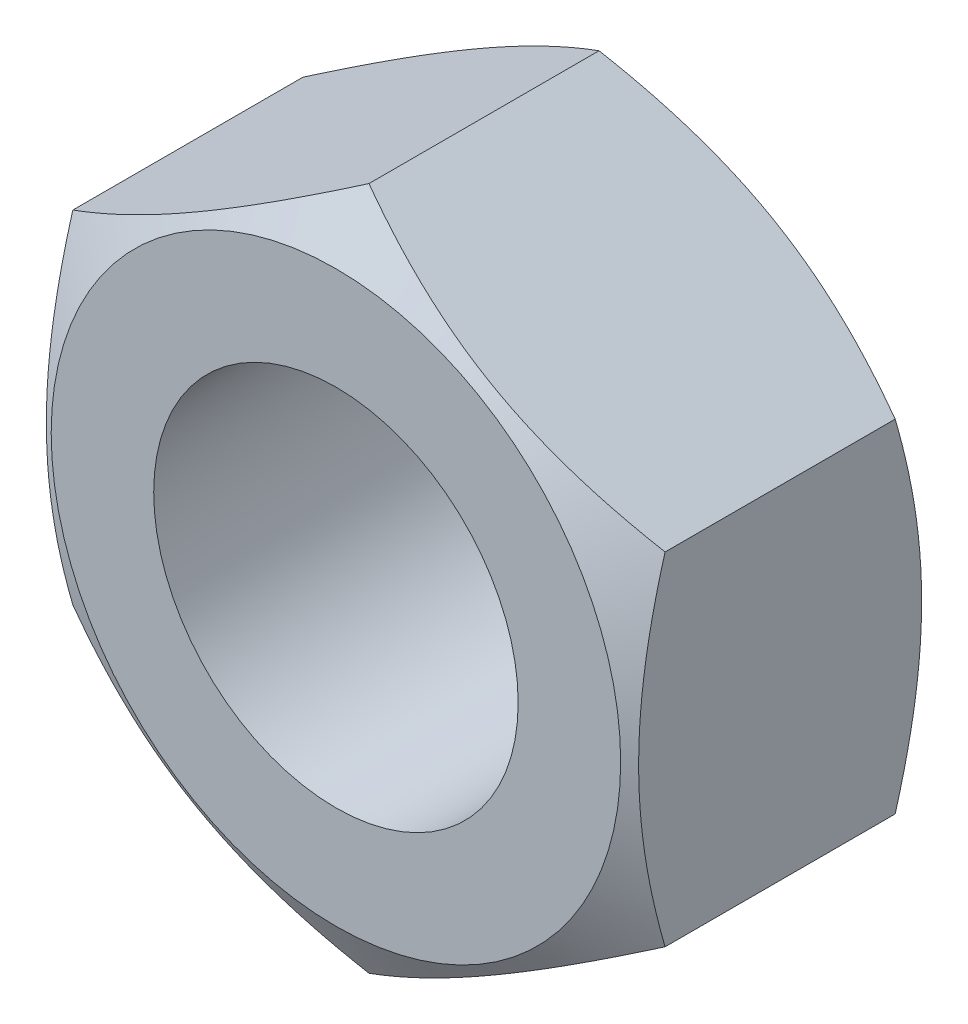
ISO-10303-21;
HEADER;
FILE_DESCRIPTION(('STEP AP214'),'2;1');
FILE_NAME('part.step','',(''),(''),'','','');
FILE_SCHEMA(('AUTOMOTIVE_DESIGN { 1 0 10303 214 1 1 1 1 }'));
ENDSEC;
DATA;
#1=APPLICATION_CONTEXT('core data for automotive mechanical design processes');
#2=APPLICATION_PROTOCOL_DEFINITION('international standard','automotive_design',2000,#1);
#3=PRODUCT_CONTEXT('',#1,'mechanical');
#4=PRODUCT('Part','Part','',(#3));
#5=PRODUCT_RELATED_PRODUCT_CATEGORY('part','',(#4));
#6=PRODUCT_DEFINITION_FORMATION('','',#4);
#7=PRODUCT_DEFINITION_CONTEXT('part definition',#1,'design');
#8=PRODUCT_DEFINITION('design','',#6,#7);
#9=PRODUCT_DEFINITION_SHAPE('','',#8);
#10=(LENGTH_UNIT() NAMED_UNIT(*) SI_UNIT(.MILLI.,.METRE.));
#11=(NAMED_UNIT(*) PLANE_ANGLE_UNIT() SI_UNIT($,.RADIAN.));
#12=(NAMED_UNIT(*) SI_UNIT($,.STERADIAN.) SOLID_ANGLE_UNIT());
#13=UNCERTAINTY_MEASURE_WITH_UNIT(LENGTH_MEASURE(1.E-05),#10,'distance_accuracy_value','');
#14=(GEOMETRIC_REPRESENTATION_CONTEXT(3) GLOBAL_UNCERTAINTY_ASSIGNED_CONTEXT((#13)) GLOBAL_UNIT_ASSIGNED_CONTEXT((#10,
#11,#12)) REPRESENTATION_CONTEXT('',''));
#15=CARTESIAN_POINT('',(0.,0.,0.));
#16=DIRECTION('',(0.,0.,1.));
#17=DIRECTION('',(1.,0.,0.));
#18=AXIS2_PLACEMENT_3D('',#15,#16,#17);
#19=CARTESIAN_POINT('',(-6.5,-3.75277674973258,6.5));
#20=DIRECTION('',(-1.,0.,0.));
#21=DIRECTION('',(0.,0.,1.));
#22=AXIS2_PLACEMENT_3D('',#19,#20,#21);
#23=PLANE('',#22);
#24=DIRECTION('',(0.,0.,-1.));
#25=VECTOR('',#24,1.);
#26=CARTESIAN_POINT('',(-6.5,-3.75277674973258,6.5));
#27=LINE('',#26,#25);
#28=CARTESIAN_POINT('',(-6.5,-3.75277674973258,5.77510584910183));
#29=VERTEX_POINT('',#28);
#30=CARTESIAN_POINT('',(-6.5,-3.75277674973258,0.724894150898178));
#31=VERTEX_POINT('',#30);
#32=EDGE_CURVE('E9',#29,#31,#27,.T.);
#33=ORIENTED_EDGE('',*,*,#32,.F.);
#34=CARTESIAN_POINT('',(-6.5,-10.0376561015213,3.20422452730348));
#35=CARTESIAN_POINT('',(-6.5,-9.75411250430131,3.34159609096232));
#36=CARTESIAN_POINT('',(-6.5,-9.46991338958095,3.477638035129));
#37=CARTESIAN_POINT('',(-6.5,-8.89985536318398,3.74631399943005));
#38=CARTESIAN_POINT('',(-6.5,-8.61399619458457,3.87894747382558));
#39=CARTESIAN_POINT('',(-6.5,-8.03877585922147,4.14073425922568));
#40=CARTESIAN_POINT('',(-6.5,-7.74940407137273,4.26986431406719));
#41=CARTESIAN_POINT('',(-6.5,-7.16834386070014,4.52278244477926));
#42=CARTESIAN_POINT('',(-6.5,-6.87665554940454,4.64657077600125));
#43=CARTESIAN_POINT('',(-6.5,-6.28125325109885,4.89119214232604));
#44=CARTESIAN_POINT('',(-6.5,-5.97744998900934,5.01180907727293));
#45=CARTESIAN_POINT('',(-6.5,-5.36627311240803,5.24381010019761));
#46=CARTESIAN_POINT('',(-6.5,-5.05889909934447,5.35519314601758));
#47=CARTESIAN_POINT('',(-6.5,-4.44068218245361,5.56577134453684));
#48=CARTESIAN_POINT('',(-6.5,-4.12984789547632,5.66499154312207));
#49=CARTESIAN_POINT('',(-6.5,-3.50371775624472,5.84803088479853));
#50=CARTESIAN_POINT('',(-6.5,-3.18842335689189,5.93185492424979));
#51=CARTESIAN_POINT('',(-6.5,-2.55494944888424,6.07961205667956));
#52=CARTESIAN_POINT('',(-6.5,-2.2367951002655,6.14365127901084));
#53=CARTESIAN_POINT('',(-6.5,-1.59653036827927,6.24817364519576));
#54=CARTESIAN_POINT('',(-6.5,-1.27442034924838,6.28865894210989));
#55=CARTESIAN_POINT('',(-6.5,-0.791708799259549,6.3290321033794));
#56=CARTESIAN_POINT('',(-6.5,-0.631917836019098,6.33909642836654));
#57=CARTESIAN_POINT('',(-6.5,-0.312046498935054,6.35246757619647));
#58=CARTESIAN_POINT('',(-6.5,-0.1519661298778,6.35577450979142));
#59=CARTESIAN_POINT('',(-6.5,0.168189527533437,6.35554451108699));
#60=CARTESIAN_POINT('',(-6.5,0.328264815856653,6.35200754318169));
#61=CARTESIAN_POINT('',(-6.5,0.648125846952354,6.33817746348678));
#62=CARTESIAN_POINT('',(-6.5,0.807911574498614,6.32788400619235));
#63=CARTESIAN_POINT('',(-6.5,1.19322981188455,6.29513066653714));
#64=CARTESIAN_POINT('',(-6.5,1.41848933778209,6.26939241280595));
#65=CARTESIAN_POINT('',(-6.5,1.86729775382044,6.20590134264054));
#66=CARTESIAN_POINT('',(-6.5,2.09084640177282,6.16814685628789));
#67=CARTESIAN_POINT('',(-6.5,2.75869205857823,6.0388642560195));
#68=CARTESIAN_POINT('',(-6.5,3.19993162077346,5.93134171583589));
#69=CARTESIAN_POINT('',(-6.5,3.85964942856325,5.7453762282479));
#70=CARTESIAN_POINT('',(-6.5,4.08156176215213,5.67841935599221));
#71=CARTESIAN_POINT('',(-6.5,4.52323021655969,5.53767302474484));
#72=CARTESIAN_POINT('',(-6.5,4.74298632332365,5.46388352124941));
#73=CARTESIAN_POINT('',(-6.5,5.18041384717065,5.31064572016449));
#74=CARTESIAN_POINT('',(-6.5,5.39808595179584,5.23119936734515));
#75=CARTESIAN_POINT('',(-6.5,5.83163487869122,5.06757047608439));
#76=CARTESIAN_POINT('',(-6.5,6.04751172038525,4.98338798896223));
#77=CARTESIAN_POINT('',(-6.5,6.55037775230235,4.78195062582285));
#78=CARTESIAN_POINT('',(-6.5,6.8367403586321,4.66313460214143));
#79=CARTESIAN_POINT('',(-6.5,7.40708826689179,4.41991162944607));
#80=CARTESIAN_POINT('',(-6.5,7.69107343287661,4.2955043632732));
#81=CARTESIAN_POINT('',(-6.5,8.25709520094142,4.04220339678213));
#82=CARTESIAN_POINT('',(-6.5,8.53913142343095,3.91330885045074));
#83=CARTESIAN_POINT('',(-6.5,9.10153191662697,3.6519160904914));
#84=CARTESIAN_POINT('',(-6.5,9.38189615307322,3.51941780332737));
#85=CARTESIAN_POINT('',(-6.5,9.94150180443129,3.25134949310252));
#86=CARTESIAN_POINT('',(-6.5,10.2207417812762,3.11577647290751));
#87=CARTESIAN_POINT('',(-6.5,10.7780317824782,2.84220418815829));
#88=CARTESIAN_POINT('',(-6.5,11.0560817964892,2.7042049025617));
#89=CARTESIAN_POINT('',(-6.5,11.8886573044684,2.28723826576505));
#90=CARTESIAN_POINT('',(-6.5,12.4416787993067,2.00526807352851));
#91=CARTESIAN_POINT('',(-6.5,13.4996337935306,1.4589862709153));
#92=CARTESIAN_POINT('',(-6.5,14.0047976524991,1.1951188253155));
#93=CARTESIAN_POINT('',(-6.5,15.0132440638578,0.663775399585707));
#94=CARTESIAN_POINT('',(-6.5,15.5165265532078,0.39629929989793));
#95=CARTESIAN_POINT('',(-6.5,16.5204177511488,-0.140765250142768));
#96=CARTESIAN_POINT('',(-6.5,17.0210299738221,-0.410347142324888));
#97=CARTESIAN_POINT('',(-6.5,18.0210477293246,-0.951677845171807));
#98=CARTESIAN_POINT('',(-6.5,18.5204533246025,-1.2234265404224));
#99=CARTESIAN_POINT('',(-6.5,19.0194129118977,-1.49598623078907));
#100=B_SPLINE_CURVE_WITH_KNOTS('',3,(#34,#35,#36,#37,#38,#39,#40,#41,#42,#43,#44,#45,#46,#47,
#48,#49,#50,#51,#52,#53,#54,#55,#56,#57,#58,#59,#60,#61,#62,#63,#64,#65,#66,#67,#68,#69,#70,#71,
#72,#73,#74,#75,#76,#77,#78,#79,#80,#81,#82,#83,#84,#85,#86,#87,#88,#89,#90,#91,#92,#93,#94,#95,
#96,#97,#98,#99),.UNSPECIFIED.,.F.,.F.,(4,2,2,2,2,2,2,2,2,2,2,2,2,2,2,2,2,2,2,2,2,2,2,2,2,2,2,2,
2,2,2,2,4),(0.,0.94521611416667,1.89058263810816,2.84116840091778,3.7917086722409,
4.77220681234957,5.75281546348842,6.73136964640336,7.70961208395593,8.68251209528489,
9.65532316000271,10.1355247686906,10.615718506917,11.0959147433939,11.5761355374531,
12.2559262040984,12.9358113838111,14.296353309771,14.9916778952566,15.6870070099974,
16.3820982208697,17.0771819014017,18.0072031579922,18.9372772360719,19.867527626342,
20.7977970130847,21.7290158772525,22.6602428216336,24.5224617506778,26.2322265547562,
27.942048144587,29.647792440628,31.3534464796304),.UNSPECIFIED.);
#101=CARTESIAN_POINT('',(-6.5,3.75277674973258,5.77510584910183));
#102=VERTEX_POINT('',#101);
#103=EDGE_CURVE('E69',#29,#102,#100,.T.);
#104=ORIENTED_EDGE('',*,*,#103,.T.);
#105=DIRECTION('',(0.,0.,-1.));
#106=VECTOR('',#105,1.);
#107=CARTESIAN_POINT('',(-6.5,3.75277674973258,6.5));
#108=LINE('',#107,#106);
#109=CARTESIAN_POINT('',(-6.5,3.75277674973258,0.724894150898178));
#110=VERTEX_POINT('',#109);
#111=EDGE_CURVE('E38',#102,#110,#108,.T.);
#112=ORIENTED_EDGE('',*,*,#111,.T.);
#113=CARTESIAN_POINT('',(-6.5,-10.0118859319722,3.28329160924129));
#114=CARTESIAN_POINT('',(-6.5,-9.72855336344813,3.14612691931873));
#115=CARTESIAN_POINT('',(-6.5,-9.44456295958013,3.01029742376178));
#116=CARTESIAN_POINT('',(-6.5,-8.87491638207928,2.74206118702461));
#117=CARTESIAN_POINT('',(-6.5,-8.58925994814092,2.60965499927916));
#118=CARTESIAN_POINT('',(-6.5,-8.01442627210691,2.34833687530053));
#119=CARTESIAN_POINT('',(-6.5,-7.72523828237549,2.21944849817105));
#120=CARTESIAN_POINT('',(-6.5,-7.14453800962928,1.96703882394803));
#121=CARTESIAN_POINT('',(-6.5,-6.85302583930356,1.84351726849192));
#122=CARTESIAN_POINT('',(-6.5,-6.25807741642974,1.59951345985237));
#123=CARTESIAN_POINT('',(-6.5,-5.95455264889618,1.47924583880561));
#124=CARTESIAN_POINT('',(-6.5,-5.34392655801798,1.24798011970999));
#125=CARTESIAN_POINT('',(-6.5,-5.03682483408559,1.13698307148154));
#126=CARTESIAN_POINT('',(-6.5,-4.41915477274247,0.927222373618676));
#127=CARTESIAN_POINT('',(-6.5,-4.10859513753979,0.828433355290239));
#128=CARTESIAN_POINT('',(-6.5,-3.48301880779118,0.646304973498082));
#129=CARTESIAN_POINT('',(-6.5,-3.16800357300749,0.562960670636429));
#130=CARTESIAN_POINT('',(-6.5,-2.53508513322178,0.416201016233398));
#131=CARTESIAN_POINT('',(-6.5,-2.21720674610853,0.352680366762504));
#132=CARTESIAN_POINT('',(-6.5,-1.577525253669,0.249221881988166));
#133=CARTESIAN_POINT('',(-6.5,-1.2557225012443,0.209281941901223));
#134=CARTESIAN_POINT('',(-6.5,-0.773490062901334,0.169711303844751));
#135=CARTESIAN_POINT('',(-6.5,-0.61385405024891,0.159910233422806));
#136=CARTESIAN_POINT('',(-6.5,-0.294303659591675,0.147056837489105));
#137=CARTESIAN_POINT('',(-6.5,-0.134389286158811,0.144004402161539));
#138=CARTESIAN_POINT('',(-6.5,0.185423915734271,0.144728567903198));
#139=CARTESIAN_POINT('',(-6.5,0.345322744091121,0.148505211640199));
#140=CARTESIAN_POINT('',(-6.5,0.66482175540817,0.16279442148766));
#141=CARTESIAN_POINT('',(-6.5,0.824421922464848,0.173307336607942));
#142=CARTESIAN_POINT('',(-6.5,1.21009106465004,0.206631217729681));
#143=CARTESIAN_POINT('',(-6.5,1.43587954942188,0.232755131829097));
#144=CARTESIAN_POINT('',(-6.5,1.88572477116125,0.297044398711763));
#145=CARTESIAN_POINT('',(-6.5,2.10978125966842,0.335211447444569));
#146=CARTESIAN_POINT('',(-6.5,2.77912789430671,0.465748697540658));
#147=CARTESIAN_POINT('',(-6.5,3.22133379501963,0.574129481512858));
#148=CARTESIAN_POINT('',(-6.5,3.88246330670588,0.76136414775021));
#149=CARTESIAN_POINT('',(-6.5,4.10483365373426,0.828741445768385));
#150=CARTESIAN_POINT('',(-6.5,4.54741339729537,0.970317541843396));
#151=CARTESIAN_POINT('',(-6.5,4.76762277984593,1.04451638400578));
#152=CARTESIAN_POINT('',(-6.5,5.20595333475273,1.19855980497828));
#153=CARTESIAN_POINT('',(-6.5,5.42407520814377,1.27840240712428));
#154=CARTESIAN_POINT('',(-6.5,5.85852369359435,1.4428115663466));
#155=CARTESIAN_POINT('',(-6.5,6.07485032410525,1.5273780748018));
#156=CARTESIAN_POINT('',(-6.5,6.57455675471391,1.7280091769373));
#157=CARTESIAN_POINT('',(-6.5,6.85735139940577,1.84552826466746));
#158=CARTESIAN_POINT('',(-6.5,7.42062861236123,2.08599704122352));
#159=CARTESIAN_POINT('',(-6.5,7.70111105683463,2.20894701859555));
#160=CARTESIAN_POINT('',(-6.5,8.26017575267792,2.45921670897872));
#161=CARTESIAN_POINT('',(-6.5,8.53875764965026,2.58653721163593));
#162=CARTESIAN_POINT('',(-6.5,9.09428863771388,2.84469787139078));
#163=CARTESIAN_POINT('',(-6.5,9.3712376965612,2.97553809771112));
#164=CARTESIAN_POINT('',(-6.5,9.92401115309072,3.24021331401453));
#165=CARTESIAN_POINT('',(-6.5,10.199834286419,3.37405094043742));
#166=CARTESIAN_POINT('',(-6.5,10.750313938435,3.64410623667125));
#167=CARTESIAN_POINT('',(-6.5,11.0249704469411,3.78032392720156));
#168=CARTESIAN_POINT('',(-6.5,11.8474745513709,4.19193510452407));
#169=CARTESIAN_POINT('',(-6.5,12.3938452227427,4.47028114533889));
#170=CARTESIAN_POINT('',(-6.5,13.189271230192,4.88066012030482));
#171=CARTESIAN_POINT('',(-6.5,13.4394696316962,5.01049135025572));
#172=CARTESIAN_POINT('',(-6.5,13.9393233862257,5.27118553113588));
#173=CARTESIAN_POINT('',(-6.5,14.1889787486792,5.40204846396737));
#174=CARTESIAN_POINT('',(-6.5,14.9372586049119,5.79598704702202));
#175=CARTESIAN_POINT('',(-6.5,15.4351776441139,6.0604025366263));
#176=CARTESIAN_POINT('',(-6.5,16.4283993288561,6.59135046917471));
#177=CARTESIAN_POINT('',(-6.5,16.9237053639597,6.85787658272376));
#178=CARTESIAN_POINT('',(-6.5,17.9131191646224,7.3930841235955));
#179=CARTESIAN_POINT('',(-6.5,18.4072269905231,7.66176543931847));
#180=CARTESIAN_POINT('',(-6.5,18.9008904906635,7.93125551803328));
#181=B_SPLINE_CURVE_WITH_KNOTS('',3,(#113,#114,#115,#116,#117,#118,#119,#120,#121,#122,#123,
#124,#125,#126,#127,#128,#129,#130,#131,#132,#133,#134,#135,#136,#137,#138,#139,#140,#141,#142,
#143,#144,#145,#146,#147,#148,#149,#150,#151,#152,#153,#154,#155,#156,#157,#158,#159,#160,#161,
#162,#163,#164,#165,#166,#167,#168,#169,#170,#171,#172,#173,#174,#175,#176,#177,#178,#179,#180),
.UNSPECIFIED.,.F.,.F.,(4,2,2,2,2,2,2,2,2,2,2,2,2,2,2,2,2,2,2,2,2,2,2,2,2,2,2,2,2,2,2,2,2,4),(0.,
0.944375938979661,1.88890360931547,2.83869006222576,3.78843074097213,4.76776487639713,
5.74720976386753,6.72458382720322,7.7016447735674,8.67342384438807,9.64511616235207,
10.1248049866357,10.6044860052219,11.0841700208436,11.5638788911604,12.2453767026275,
12.9269705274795,14.2909426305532,14.9879481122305,15.6849581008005,16.3817251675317,
17.0784850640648,17.9971327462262,18.9158292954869,19.8346927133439,20.753574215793,
21.6732984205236,22.5930306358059,24.4325333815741,25.2781675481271,26.1237869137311,
27.8150905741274,29.5024730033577,31.1897686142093),.UNSPECIFIED.);
#182=EDGE_CURVE('E89',#31,#110,#181,.T.);
#183=ORIENTED_EDGE('',*,*,#182,.F.);
#184=EDGE_LOOP('',(#33,#104,#112,#183));
#185=FACE_BOUND('',#184,.T.);
#186=ADVANCED_FACE('F14',(#185),#23,.T.);
#187=CARTESIAN_POINT('',(-6.5,-3.75277674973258,6.5));
#188=DIRECTION('',(0.5,0.866025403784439,0.));
#189=DIRECTION('',(-0.866025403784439,0.5,0.));
#190=AXIS2_PLACEMENT_3D('',#187,#188,#189);
#191=PLANE('',#190);
#192=CARTESIAN_POINT('',(-6.5002,-3.75266127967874,5.77503918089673));
#193=CARTESIAN_POINT('',(-6.35732254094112,-3.83515161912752,5.82265800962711));
#194=CARTESIAN_POINT('',(-6.21391236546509,-3.91794952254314,5.86811573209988));
#195=CARTESIAN_POINT('',(-5.9259273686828,-4.08421773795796,5.95411375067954));
#196=CARTESIAN_POINT('',(-5.78135207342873,-4.16768832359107,5.99465192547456));
#197=CARTESIAN_POINT('',(-5.34531134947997,-4.41943655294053,6.10809143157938));
#198=CARTESIAN_POINT('',(-5.05212471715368,-4.58870793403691,6.17261462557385));
#199=CARTESIAN_POINT('',(-4.61337625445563,-4.84201947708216,6.2482758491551));
#200=CARTESIAN_POINT('',(-4.46912536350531,-4.92530276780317,6.2698295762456));
#201=CARTESIAN_POINT('',(-4.17997178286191,-5.09224566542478,6.30597211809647));
#202=CARTESIAN_POINT('',(-4.03506915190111,-5.17590523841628,6.32056154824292));
#203=CARTESIAN_POINT('',(-3.74501222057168,-5.34336968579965,6.34240368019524));
#204=CARTESIAN_POINT('',(-3.59985839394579,-5.42717428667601,6.34966470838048));
#205=CARTESIAN_POINT('',(-3.30942466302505,-5.59485627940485,6.35670213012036));
#206=CARTESIAN_POINT('',(-3.16414476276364,-5.67873366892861,6.35647875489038));
#207=CARTESIAN_POINT('',(-2.76612405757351,-5.90853103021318,6.34557897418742));
#208=CARTESIAN_POINT('',(-2.51351353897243,-6.05437578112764,6.32728061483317));
#209=CARTESIAN_POINT('',(-2.00997032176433,-6.34509659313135,6.26925609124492));
#210=CARTESIAN_POINT('',(-1.75903939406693,-6.48997163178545,6.22951009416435));
#211=CARTESIAN_POINT('',(-1.25448277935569,-6.78127752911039,6.13015652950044));
#212=CARTESIAN_POINT('',(-1.0009207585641,-6.92767163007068,6.07012800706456));
#213=CARTESIAN_POINT('',(-0.497578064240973,-7.21827667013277,5.93388744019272));
#214=CARTESIAN_POINT('',(-0.247790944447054,-7.36249133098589,5.857707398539));
#215=CARTESIAN_POINT('',(0.000199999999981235,-7.50566896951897,5.77503918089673));
#216=B_SPLINE_CURVE_WITH_KNOTS('',3,(#192,#193,#194,#195,#196,#197,#198,#199,#200,#201,#202,
#203,#204,#205,#206,#207,#208,#209,#210,#211,#212,#213,#214,#215),.UNSPECIFIED.,.F.,.F.,(4,2,2,
2,2,2,2,2,2,2,2,4),(0.,0.515105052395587,1.03043143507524,2.06322554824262,2.56697389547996,
3.07067772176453,3.57380860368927,4.07692394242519,4.95279354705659,5.82947446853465,
6.72559912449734,7.61996451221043),.UNSPECIFIED.);
#217=CARTESIAN_POINT('',(0.,-7.50555349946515,5.77510584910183));
#218=VERTEX_POINT('',#217);
#219=EDGE_CURVE('E77',#29,#218,#216,.T.);
#220=ORIENTED_EDGE('',*,*,#219,.F.);
#221=ORIENTED_EDGE('',*,*,#32,.T.);
#222=CARTESIAN_POINT('',(-6.5002,-3.75266127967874,0.724960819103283));
#223=CARTESIAN_POINT('',(-6.35732254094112,-3.83515161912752,0.677341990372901));
#224=CARTESIAN_POINT('',(-6.21391236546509,-3.91794952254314,0.631884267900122));
#225=CARTESIAN_POINT('',(-5.9259273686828,-4.08421773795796,0.54588624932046));
#226=CARTESIAN_POINT('',(-5.78135207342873,-4.16768832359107,0.505348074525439));
#227=CARTESIAN_POINT('',(-5.34531134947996,-4.41943655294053,0.391908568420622));
#228=CARTESIAN_POINT('',(-5.05212471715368,-4.58870793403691,0.327385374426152));
#229=CARTESIAN_POINT('',(-4.61337625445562,-4.84201947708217,0.251724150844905));
#230=CARTESIAN_POINT('',(-4.4691253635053,-4.92530276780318,0.230170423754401));
#231=CARTESIAN_POINT('',(-4.1799717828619,-5.09224566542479,0.194027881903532));
#232=CARTESIAN_POINT('',(-4.0350691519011,-5.17590523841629,0.17943845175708));
#233=CARTESIAN_POINT('',(-3.74501222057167,-5.34336968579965,0.157596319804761));
#234=CARTESIAN_POINT('',(-3.59985839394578,-5.42717428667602,0.150335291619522));
#235=CARTESIAN_POINT('',(-3.30942466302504,-5.59485627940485,0.143297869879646));
#236=CARTESIAN_POINT('',(-3.16414476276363,-5.67873366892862,0.143521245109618));
#237=CARTESIAN_POINT('',(-2.7661240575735,-5.90853103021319,0.154421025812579));
#238=CARTESIAN_POINT('',(-2.51351353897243,-6.05437578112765,0.172719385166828));
#239=CARTESIAN_POINT('',(-2.00997032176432,-6.34509659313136,0.230743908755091));
#240=CARTESIAN_POINT('',(-1.75903939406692,-6.48997163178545,0.27048990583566));
#241=CARTESIAN_POINT('',(-1.25448277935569,-6.78127752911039,0.369843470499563));
#242=CARTESIAN_POINT('',(-1.0009207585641,-6.92767163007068,0.429871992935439));
#243=CARTESIAN_POINT('',(-0.497578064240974,-7.21827667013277,0.56611255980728));
#244=CARTESIAN_POINT('',(-0.247790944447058,-7.36249133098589,0.642292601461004));
#245=CARTESIAN_POINT('',(0.000199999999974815,-7.50566896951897,0.724960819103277));
#246=B_SPLINE_CURVE_WITH_KNOTS('',3,(#222,#223,#224,#225,#226,#227,#228,#229,#230,#231,#232,
#233,#234,#235,#236,#237,#238,#239,#240,#241,#242,#243,#244,#245),.UNSPECIFIED.,.F.,.F.,(4,2,2,
2,2,2,2,2,2,2,2,4),(0.,0.515105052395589,1.03043143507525,2.06322554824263,2.56697389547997,
3.07067772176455,3.57380860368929,4.07692394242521,4.9527935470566,5.82947446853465,
6.72559912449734,7.61996451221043),.UNSPECIFIED.);
#247=CARTESIAN_POINT('',(0.,-7.50555349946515,0.724894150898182));
#248=VERTEX_POINT('',#247);
#249=EDGE_CURVE('E111',#31,#248,#246,.T.);
#250=ORIENTED_EDGE('',*,*,#249,.T.);
#251=DIRECTION('',(0.,0.,-1.));
#252=VECTOR('',#251,1.);
#253=CARTESIAN_POINT('',(0.,-7.50555349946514,6.5));
#254=LINE('',#253,#252);
#255=EDGE_CURVE('E23',#218,#248,#254,.T.);
#256=ORIENTED_EDGE('',*,*,#255,.F.);
#257=EDGE_LOOP('',(#220,#221,#250,#256));
#258=FACE_BOUND('',#257,.T.);
#259=ADVANCED_FACE('F16',(#258),#191,.F.);
#260=CARTESIAN_POINT('',(6.5,-3.75277674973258,6.5));
#261=DIRECTION('',(0.5,-0.86602540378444,0.));
#262=DIRECTION('',(0.86602540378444,0.5,0.));
#263=AXIS2_PLACEMENT_3D('',#260,#261,#262);
#264=PLANE('',#263);
#265=DIRECTION('',(0.,0.,-1.));
#266=VECTOR('',#265,1.);
#267=CARTESIAN_POINT('',(6.5,-3.75277674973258,6.5));
#268=LINE('',#267,#266);
#269=CARTESIAN_POINT('',(6.5,-3.75277674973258,5.77510584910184));
#270=VERTEX_POINT('',#269);
#271=CARTESIAN_POINT('',(6.5,-3.75277674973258,0.724894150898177));
#272=VERTEX_POINT('',#271);
#273=EDGE_CURVE('E94',#270,#272,#268,.T.);
#274=ORIENTED_EDGE('',*,*,#273,.F.);
#275=CARTESIAN_POINT('',(6.5002,-3.75266127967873,5.77503918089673));
#276=CARTESIAN_POINT('',(6.35732254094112,-3.83515161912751,5.82265800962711));
#277=CARTESIAN_POINT('',(6.21391236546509,-3.91794952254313,5.86811573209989));
#278=CARTESIAN_POINT('',(5.9259273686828,-4.08421773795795,5.95411375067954));
#279=CARTESIAN_POINT('',(5.78135207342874,-4.16768832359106,5.99465192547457));
#280=CARTESIAN_POINT('',(5.34531134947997,-4.41943655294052,6.10809143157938));
#281=CARTESIAN_POINT('',(5.05212471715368,-4.5887079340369,6.17261462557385));
#282=CARTESIAN_POINT('',(4.61337625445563,-4.84201947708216,6.2482758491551));
#283=CARTESIAN_POINT('',(4.46912536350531,-4.92530276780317,6.2698295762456));
#284=CARTESIAN_POINT('',(4.17997178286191,-5.09224566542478,6.30597211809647));
#285=CARTESIAN_POINT('',(4.03506915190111,-5.17590523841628,6.32056154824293));
#286=CARTESIAN_POINT('',(3.74501222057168,-5.34336968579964,6.34240368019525));
#287=CARTESIAN_POINT('',(3.59985839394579,-5.427174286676,6.34966470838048));
#288=CARTESIAN_POINT('',(3.30942466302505,-5.59485627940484,6.35670213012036));
#289=CARTESIAN_POINT('',(3.16414476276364,-5.67873366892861,6.35647875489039));
#290=CARTESIAN_POINT('',(2.76612405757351,-5.90853103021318,6.34557897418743));
#291=CARTESIAN_POINT('',(2.51351353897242,-6.05437578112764,6.32728061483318));
#292=CARTESIAN_POINT('',(2.00997032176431,-6.34509659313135,6.26925609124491));
#293=CARTESIAN_POINT('',(1.7590393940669,-6.48997163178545,6.22951009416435));
#294=CARTESIAN_POINT('',(1.25448277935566,-6.7812775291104,6.13015652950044));
#295=CARTESIAN_POINT('',(1.00092075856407,-6.92767163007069,6.07012800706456));
#296=CARTESIAN_POINT('',(0.497578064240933,-7.21827667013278,5.93388744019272));
#297=CARTESIAN_POINT('',(0.247790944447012,-7.3624913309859,5.85770739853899));
#298=CARTESIAN_POINT('',(-0.000200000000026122,-7.50566896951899,5.77503918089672));
#299=B_SPLINE_CURVE_WITH_KNOTS('',3,(#275,#276,#277,#278,#279,#280,#281,#282,#283,#284,#285,
#286,#287,#288,#289,#290,#291,#292,#293,#294,#295,#296,#297,#298),.UNSPECIFIED.,.F.,.F.,(4,2,2,
2,2,2,2,2,2,2,2,4),(0.,0.515105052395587,1.03043143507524,2.06322554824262,2.56697389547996,
3.07067772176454,3.57380860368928,4.0769239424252,4.95279354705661,5.82947446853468,
6.72559912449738,7.61996451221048),.UNSPECIFIED.);
#300=EDGE_CURVE('E103',#270,#218,#299,.T.);
#301=ORIENTED_EDGE('',*,*,#300,.T.);
#302=ORIENTED_EDGE('',*,*,#255,.T.);
#303=CARTESIAN_POINT('',(6.5002,-3.75266127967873,0.724960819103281));
#304=CARTESIAN_POINT('',(6.35732254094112,-3.83515161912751,0.677341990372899));
#305=CARTESIAN_POINT('',(6.21391236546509,-3.91794952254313,0.63188426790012));
#306=CARTESIAN_POINT('',(5.9259273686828,-4.08421773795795,0.545886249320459));
#307=CARTESIAN_POINT('',(5.78135207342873,-4.16768832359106,0.505348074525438));
#308=CARTESIAN_POINT('',(5.34531134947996,-4.41943655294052,0.39190856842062));
#309=CARTESIAN_POINT('',(5.05212471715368,-4.5887079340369,0.327385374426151));
#310=CARTESIAN_POINT('',(4.61337625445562,-4.84201947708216,0.251724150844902));
#311=CARTESIAN_POINT('',(4.4691253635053,-4.92530276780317,0.230170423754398));
#312=CARTESIAN_POINT('',(4.17997178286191,-5.09224566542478,0.194027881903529));
#313=CARTESIAN_POINT('',(4.0350691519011,-5.17590523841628,0.179438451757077));
#314=CARTESIAN_POINT('',(3.74501222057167,-5.34336968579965,0.157596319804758));
#315=CARTESIAN_POINT('',(3.59985839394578,-5.42717428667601,0.150335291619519));
#316=CARTESIAN_POINT('',(3.30942466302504,-5.59485627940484,0.143297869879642));
#317=CARTESIAN_POINT('',(3.16414476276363,-5.67873366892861,0.143521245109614));
#318=CARTESIAN_POINT('',(2.7661240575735,-5.90853103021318,0.154421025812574));
#319=CARTESIAN_POINT('',(2.51351353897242,-6.05437578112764,0.172719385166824));
#320=CARTESIAN_POINT('',(2.00997032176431,-6.34509659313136,0.230743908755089));
#321=CARTESIAN_POINT('',(1.7590393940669,-6.48997163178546,0.270489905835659));
#322=CARTESIAN_POINT('',(1.25448277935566,-6.7812775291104,0.369843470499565));
#323=CARTESIAN_POINT('',(1.00092075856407,-6.92767163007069,0.429871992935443));
#324=CARTESIAN_POINT('',(0.497578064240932,-7.21827667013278,0.566112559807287));
#325=CARTESIAN_POINT('',(0.247790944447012,-7.3624913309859,0.642292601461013));
#326=CARTESIAN_POINT('',(-0.000200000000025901,-7.50566896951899,0.724960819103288));
#327=B_SPLINE_CURVE_WITH_KNOTS('',3,(#303,#304,#305,#306,#307,#308,#309,#310,#311,#312,#313,
#314,#315,#316,#317,#318,#319,#320,#321,#322,#323,#324,#325,#326),.UNSPECIFIED.,.F.,.F.,(4,2,2,
2,2,2,2,2,2,2,2,4),(0.,0.515105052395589,1.03043143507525,2.06322554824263,2.56697389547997,
3.07067772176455,3.57380860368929,4.07692394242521,4.95279354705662,5.82947446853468,
6.72559912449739,7.61996451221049),.UNSPECIFIED.);
#328=EDGE_CURVE('E102',#272,#248,#327,.T.);
#329=ORIENTED_EDGE('',*,*,#328,.F.);
#330=EDGE_LOOP('',(#274,#301,#302,#329));
#331=FACE_BOUND('',#330,.T.);
#332=ADVANCED_FACE('F101',(#331),#264,.T.);
#333=CARTESIAN_POINT('',(6.5,-3.75277674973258,6.5));
#334=DIRECTION('',(-1.,0.,0.));
#335=DIRECTION('',(0.,0.,1.));
#336=AXIS2_PLACEMENT_3D('',#333,#334,#335);
#337=PLANE('',#336);
#338=CARTESIAN_POINT('',(6.5,-10.0376561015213,3.20422452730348));
#339=CARTESIAN_POINT('',(6.5,-9.75411250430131,3.34159609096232));
#340=CARTESIAN_POINT('',(6.5,-9.46991338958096,3.477638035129));
#341=CARTESIAN_POINT('',(6.5,-8.89985536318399,3.74631399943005));
#342=CARTESIAN_POINT('',(6.5,-8.61399619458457,3.87894747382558));
#343=CARTESIAN_POINT('',(6.5,-8.03877585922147,4.14073425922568));
#344=CARTESIAN_POINT('',(6.5,-7.74940407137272,4.2698643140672));
#345=CARTESIAN_POINT('',(6.5,-7.16834386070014,4.52278244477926));
#346=CARTESIAN_POINT('',(6.5,-6.87665554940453,4.64657077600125));
#347=CARTESIAN_POINT('',(6.5,-6.28125325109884,4.89119214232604));
#348=CARTESIAN_POINT('',(6.5,-5.97744998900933,5.01180907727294));
#349=CARTESIAN_POINT('',(6.5,-5.36627311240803,5.24381010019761));
#350=CARTESIAN_POINT('',(6.5,-5.05889909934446,5.35519314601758));
#351=CARTESIAN_POINT('',(6.5,-4.44068218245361,5.56577134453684));
#352=CARTESIAN_POINT('',(6.5,-4.12984789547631,5.66499154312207));
#353=CARTESIAN_POINT('',(6.5,-3.50371775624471,5.84803088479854));
#354=CARTESIAN_POINT('',(6.5,-3.18842335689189,5.93185492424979));
#355=CARTESIAN_POINT('',(6.5,-2.55494944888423,6.07961205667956));
#356=CARTESIAN_POINT('',(6.5,-2.23679510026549,6.14365127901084));
#357=CARTESIAN_POINT('',(6.5,-1.59653036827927,6.24817364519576));
#358=CARTESIAN_POINT('',(6.5,-1.27442034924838,6.2886589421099));
#359=CARTESIAN_POINT('',(6.5,-0.791708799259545,6.3290321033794));
#360=CARTESIAN_POINT('',(6.5,-0.631917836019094,6.33909642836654));
#361=CARTESIAN_POINT('',(6.5,-0.31204649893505,6.35246757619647));
#362=CARTESIAN_POINT('',(6.5,-0.151966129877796,6.35577450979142));
#363=CARTESIAN_POINT('',(6.5,0.16818952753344,6.35554451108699));
#364=CARTESIAN_POINT('',(6.5,0.328264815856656,6.35200754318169));
#365=CARTESIAN_POINT('',(6.5,0.648125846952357,6.33817746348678));
#366=CARTESIAN_POINT('',(6.5,0.807911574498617,6.32788400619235));
#367=CARTESIAN_POINT('',(6.5,1.19322981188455,6.29513066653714));
#368=CARTESIAN_POINT('',(6.5,1.4184893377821,6.26939241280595));
#369=CARTESIAN_POINT('',(6.5,1.86729775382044,6.20590134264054));
#370=CARTESIAN_POINT('',(6.5,2.09084640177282,6.16814685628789));
#371=CARTESIAN_POINT('',(6.5,2.75869205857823,6.03886425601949));
#372=CARTESIAN_POINT('',(6.5,3.19993162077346,5.93134171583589));
#373=CARTESIAN_POINT('',(6.5,3.85964942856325,5.7453762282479));
#374=CARTESIAN_POINT('',(6.5,4.08156176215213,5.67841935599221));
#375=CARTESIAN_POINT('',(6.5,4.52323021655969,5.53767302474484));
#376=CARTESIAN_POINT('',(6.5,4.74298632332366,5.4638835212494));
#377=CARTESIAN_POINT('',(6.5,5.18041384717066,5.31064572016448));
#378=CARTESIAN_POINT('',(6.5,5.39808595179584,5.23119936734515));
#379=CARTESIAN_POINT('',(6.5,5.83163487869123,5.06757047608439));
#380=CARTESIAN_POINT('',(6.5,6.04751172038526,4.98338798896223));
#381=CARTESIAN_POINT('',(6.5,6.55037775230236,4.78195062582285));
#382=CARTESIAN_POINT('',(6.5,6.8367403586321,4.66313460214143));
#383=CARTESIAN_POINT('',(6.5,7.40708826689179,4.41991162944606));
#384=CARTESIAN_POINT('',(6.5,7.69107343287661,4.29550436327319));
#385=CARTESIAN_POINT('',(6.5,8.25709520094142,4.04220339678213));
#386=CARTESIAN_POINT('',(6.5,8.53913142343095,3.91330885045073));
#387=CARTESIAN_POINT('',(6.5,9.10153191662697,3.65191609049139));
#388=CARTESIAN_POINT('',(6.5,9.38189615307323,3.51941780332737));
#389=CARTESIAN_POINT('',(6.5,9.9415018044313,3.25134949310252));
#390=CARTESIAN_POINT('',(6.5,10.2207417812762,3.11577647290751));
#391=CARTESIAN_POINT('',(6.5,10.7780317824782,2.84220418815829));
#392=CARTESIAN_POINT('',(6.5,11.0560817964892,2.7042049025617));
#393=CARTESIAN_POINT('',(6.5,11.8886573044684,2.28723826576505));
#394=CARTESIAN_POINT('',(6.5,12.4416787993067,2.00526807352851));
#395=CARTESIAN_POINT('',(6.5,13.4996337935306,1.4589862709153));
#396=CARTESIAN_POINT('',(6.5,14.0047976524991,1.1951188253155));
#397=CARTESIAN_POINT('',(6.5,15.0132440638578,0.663775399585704));
#398=CARTESIAN_POINT('',(6.5,15.5165265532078,0.396299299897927));
#399=CARTESIAN_POINT('',(6.5,16.5204177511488,-0.140765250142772));
#400=CARTESIAN_POINT('',(6.5,17.0210299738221,-0.410347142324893));
#401=CARTESIAN_POINT('',(6.5,18.0210477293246,-0.95167784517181));
#402=CARTESIAN_POINT('',(6.5,18.5204533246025,-1.2234265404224));
#403=CARTESIAN_POINT('',(6.5,19.0194129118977,-1.49598623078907));
#404=B_SPLINE_CURVE_WITH_KNOTS('',3,(#338,#339,#340,#341,#342,#343,#344,#345,#346,#347,#348,
#349,#350,#351,#352,#353,#354,#355,#356,#357,#358,#359,#360,#361,#362,#363,#364,#365,#366,#367,
#368,#369,#370,#371,#372,#373,#374,#375,#376,#377,#378,#379,#380,#381,#382,#383,#384,#385,#386,
#387,#388,#389,#390,#391,#392,#393,#394,#395,#396,#397,#398,#399,#400,#401,#402,#403),
.UNSPECIFIED.,.F.,.F.,(4,2,2,2,2,2,2,2,2,2,2,2,2,2,2,2,2,2,2,2,2,2,2,2,2,2,2,2,2,2,2,2,4),(0.,
0.945216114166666,1.89058263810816,2.84116840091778,3.7917086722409,4.77220681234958,
5.75281546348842,6.73136964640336,7.70961208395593,8.68251209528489,9.65532316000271,
10.1355247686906,10.615718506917,11.0959147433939,11.5761355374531,12.2559262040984,
12.9358113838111,14.296353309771,14.9916778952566,15.6870070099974,16.3820982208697,
17.0771819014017,18.0072031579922,18.9372772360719,19.867527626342,20.7977970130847,
21.7290158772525,22.6602428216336,24.5224617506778,26.2322265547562,27.942048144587,
29.647792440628,31.3534464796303),.UNSPECIFIED.);
#405=CARTESIAN_POINT('',(6.5,3.75277674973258,5.77510584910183));
#406=VERTEX_POINT('',#405);
#407=EDGE_CURVE('E173',#270,#406,#404,.T.);
#408=ORIENTED_EDGE('',*,*,#407,.F.);
#409=ORIENTED_EDGE('',*,*,#273,.T.);
#410=CARTESIAN_POINT('',(6.5,-10.0118859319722,3.28329160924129));
#411=CARTESIAN_POINT('',(6.5,-9.72855336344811,3.14612691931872));
#412=CARTESIAN_POINT('',(6.5,-9.44456295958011,3.01029742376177));
#413=CARTESIAN_POINT('',(6.5,-8.87491638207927,2.7420611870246));
#414=CARTESIAN_POINT('',(6.5,-8.5892599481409,2.60965499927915));
#415=CARTESIAN_POINT('',(6.5,-8.01442627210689,2.34833687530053));
#416=CARTESIAN_POINT('',(6.5,-7.72523828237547,2.21944849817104));
#417=CARTESIAN_POINT('',(6.5,-7.14453800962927,1.96703882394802));
#418=CARTESIAN_POINT('',(6.5,-6.85302583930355,1.84351726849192));
#419=CARTESIAN_POINT('',(6.5,-6.25807741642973,1.59951345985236));
#420=CARTESIAN_POINT('',(6.5,-5.95455264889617,1.4792458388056));
#421=CARTESIAN_POINT('',(6.5,-5.34392655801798,1.24798011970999));
#422=CARTESIAN_POINT('',(6.5,-5.03682483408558,1.13698307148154));
#423=CARTESIAN_POINT('',(6.5,-4.41915477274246,0.927222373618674));
#424=CARTESIAN_POINT('',(6.5,-4.10859513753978,0.828433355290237));
#425=CARTESIAN_POINT('',(6.5,-3.48301880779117,0.646304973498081));
#426=CARTESIAN_POINT('',(6.5,-3.16800357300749,0.562960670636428));
#427=CARTESIAN_POINT('',(6.5,-2.53508513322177,0.416201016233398));
#428=CARTESIAN_POINT('',(6.5,-2.21720674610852,0.352680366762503));
#429=CARTESIAN_POINT('',(6.5,-1.577525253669,0.249221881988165));
#430=CARTESIAN_POINT('',(6.5,-1.25572250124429,0.209281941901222));
#431=CARTESIAN_POINT('',(6.5,-0.773490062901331,0.16971130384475));
#432=CARTESIAN_POINT('',(6.5,-0.613854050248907,0.159910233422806));
#433=CARTESIAN_POINT('',(6.5,-0.294303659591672,0.147056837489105));
#434=CARTESIAN_POINT('',(6.5,-0.134389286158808,0.144004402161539));
#435=CARTESIAN_POINT('',(6.5,0.185423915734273,0.144728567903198));
#436=CARTESIAN_POINT('',(6.5,0.345322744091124,0.148505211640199));
#437=CARTESIAN_POINT('',(6.5,0.664821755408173,0.16279442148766));
#438=CARTESIAN_POINT('',(6.5,0.824421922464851,0.173307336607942));
#439=CARTESIAN_POINT('',(6.5,1.21009106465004,0.206631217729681));
#440=CARTESIAN_POINT('',(6.5,1.43587954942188,0.232755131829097));
#441=CARTESIAN_POINT('',(6.5,1.88572477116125,0.297044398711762));
#442=CARTESIAN_POINT('',(6.5,2.10978125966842,0.335211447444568));
#443=CARTESIAN_POINT('',(6.5,2.77912789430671,0.465748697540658));
#444=CARTESIAN_POINT('',(6.5,3.22133379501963,0.574129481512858));
#445=CARTESIAN_POINT('',(6.5,3.88246330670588,0.76136414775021));
#446=CARTESIAN_POINT('',(6.5,4.10483365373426,0.828741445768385));
#447=CARTESIAN_POINT('',(6.5,4.54741339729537,0.970317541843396));
#448=CARTESIAN_POINT('',(6.5,4.76762277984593,1.04451638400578));
#449=CARTESIAN_POINT('',(6.5,5.20595333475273,1.19855980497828));
#450=CARTESIAN_POINT('',(6.5,5.42407520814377,1.27840240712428));
#451=CARTESIAN_POINT('',(6.5,5.85852369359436,1.4428115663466));
#452=CARTESIAN_POINT('',(6.5,6.07485032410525,1.5273780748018));
#453=CARTESIAN_POINT('',(6.5,6.57455675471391,1.7280091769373));
#454=CARTESIAN_POINT('',(6.5,6.85735139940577,1.84552826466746));
#455=CARTESIAN_POINT('',(6.5,7.42062861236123,2.08599704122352));
#456=CARTESIAN_POINT('',(6.5,7.70111105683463,2.20894701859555));
#457=CARTESIAN_POINT('',(6.5,8.26017575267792,2.45921670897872));
#458=CARTESIAN_POINT('',(6.5,8.53875764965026,2.58653721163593));
#459=CARTESIAN_POINT('',(6.5,9.09428863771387,2.84469787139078));
#460=CARTESIAN_POINT('',(6.5,9.3712376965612,2.97553809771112));
#461=CARTESIAN_POINT('',(6.5,9.92401115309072,3.24021331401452));
#462=CARTESIAN_POINT('',(6.5,10.1998342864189,3.37405094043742));
#463=CARTESIAN_POINT('',(6.5,10.750313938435,3.64410623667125));
#464=CARTESIAN_POINT('',(6.5,11.0249704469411,3.78032392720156));
#465=CARTESIAN_POINT('',(6.5,11.8474745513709,4.19193510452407));
#466=CARTESIAN_POINT('',(6.5,12.3938452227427,4.47028114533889));
#467=CARTESIAN_POINT('',(6.5,13.189271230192,4.88066012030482));
#468=CARTESIAN_POINT('',(6.5,13.4394696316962,5.01049135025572));
#469=CARTESIAN_POINT('',(6.5,13.9393233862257,5.27118553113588));
#470=CARTESIAN_POINT('',(6.5,14.1889787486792,5.40204846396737));
#471=CARTESIAN_POINT('',(6.5,14.9372586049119,5.79598704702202));
#472=CARTESIAN_POINT('',(6.5,15.4351776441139,6.0604025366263));
#473=CARTESIAN_POINT('',(6.5,16.4283993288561,6.59135046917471));
#474=CARTESIAN_POINT('',(6.5,16.9237053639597,6.85787658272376));
#475=CARTESIAN_POINT('',(6.5,17.9131191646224,7.39308412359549));
#476=CARTESIAN_POINT('',(6.5,18.4072269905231,7.66176543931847));
#477=CARTESIAN_POINT('',(6.5,18.9008904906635,7.93125551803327));
#478=B_SPLINE_CURVE_WITH_KNOTS('',3,(#410,#411,#412,#413,#414,#415,#416,#417,#418,#419,#420,
#421,#422,#423,#424,#425,#426,#427,#428,#429,#430,#431,#432,#433,#434,#435,#436,#437,#438,#439,
#440,#441,#442,#443,#444,#445,#446,#447,#448,#449,#450,#451,#452,#453,#454,#455,#456,#457,#458,
#459,#460,#461,#462,#463,#464,#465,#466,#467,#468,#469,#470,#471,#472,#473,#474,#475,#476,#477),
.UNSPECIFIED.,.F.,.F.,(4,2,2,2,2,2,2,2,2,2,2,2,2,2,2,2,2,2,2,2,2,2,2,2,2,2,2,2,2,2,2,2,2,4),(0.,
0.944375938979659,1.88890360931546,2.83869006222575,3.78843074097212,4.76776487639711,
5.74720976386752,6.7245838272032,7.70164477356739,8.67342384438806,9.64511616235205,
10.1248049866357,10.6044860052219,11.0841700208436,11.5638788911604,12.2453767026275,
12.9269705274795,14.2909426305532,14.9879481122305,15.6849581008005,16.3817251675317,
17.0784850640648,17.9971327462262,18.9158292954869,19.8346927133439,20.753574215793,
21.6732984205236,22.5930306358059,24.432533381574,25.2781675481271,26.1237869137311,
27.8150905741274,29.5024730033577,31.1897686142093),.UNSPECIFIED.);
#479=CARTESIAN_POINT('',(6.5,3.75277674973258,0.724894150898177));
#480=VERTEX_POINT('',#479);
#481=EDGE_CURVE('E114',#272,#480,#478,.T.);
#482=ORIENTED_EDGE('',*,*,#481,.T.);
#483=DIRECTION('',(0.,0.,-1.));
#484=VECTOR('',#483,1.);
#485=CARTESIAN_POINT('',(6.5,3.75277674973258,6.5));
#486=LINE('',#485,#484);
#487=EDGE_CURVE('E86',#406,#480,#486,.T.);
#488=ORIENTED_EDGE('',*,*,#487,.F.);
#489=EDGE_LOOP('',(#408,#409,#482,#488));
#490=FACE_BOUND('',#489,.T.);
#491=ADVANCED_FACE('F164',(#490),#337,.F.);
#492=CARTESIAN_POINT('',(6.5,3.75277674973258,6.5));
#493=DIRECTION('',(-0.5,-0.86602540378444,0.));
#494=DIRECTION('',(0.86602540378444,-0.5,0.));
#495=AXIS2_PLACEMENT_3D('',#492,#493,#494);
#496=PLANE('',#495);
#497=CARTESIAN_POINT('',(6.5002,3.75266127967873,5.77503918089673));
#498=CARTESIAN_POINT('',(6.35732254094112,3.83515161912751,5.82265800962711));
#499=CARTESIAN_POINT('',(6.21391236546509,3.91794952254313,5.86811573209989));
#500=CARTESIAN_POINT('',(5.9259273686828,4.08421773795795,5.95411375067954));
#501=CARTESIAN_POINT('',(5.78135207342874,4.16768832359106,5.99465192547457));
#502=CARTESIAN_POINT('',(5.34531134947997,4.41943655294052,6.10809143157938));
#503=CARTESIAN_POINT('',(5.05212471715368,4.5887079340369,6.17261462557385));
#504=CARTESIAN_POINT('',(4.61337625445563,4.84201947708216,6.2482758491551));
#505=CARTESIAN_POINT('',(4.46912536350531,4.92530276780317,6.2698295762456));
#506=CARTESIAN_POINT('',(4.17997178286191,5.09224566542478,6.30597211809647));
#507=CARTESIAN_POINT('',(4.03506915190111,5.17590523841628,6.32056154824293));
#508=CARTESIAN_POINT('',(3.74501222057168,5.34336968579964,6.34240368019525));
#509=CARTESIAN_POINT('',(3.59985839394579,5.427174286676,6.34966470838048));
#510=CARTESIAN_POINT('',(3.30942466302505,5.59485627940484,6.35670213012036));
#511=CARTESIAN_POINT('',(3.16414476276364,5.67873366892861,6.35647875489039));
#512=CARTESIAN_POINT('',(2.76612405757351,5.90853103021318,6.34557897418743));
#513=CARTESIAN_POINT('',(2.51351353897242,6.05437578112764,6.32728061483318));
#514=CARTESIAN_POINT('',(2.00997032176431,6.34509659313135,6.26925609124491));
#515=CARTESIAN_POINT('',(1.7590393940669,6.48997163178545,6.22951009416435));
#516=CARTESIAN_POINT('',(1.25448277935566,6.7812775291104,6.13015652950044));
#517=CARTESIAN_POINT('',(1.00092075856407,6.92767163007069,6.07012800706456));
#518=CARTESIAN_POINT('',(0.497578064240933,7.21827667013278,5.93388744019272));
#519=CARTESIAN_POINT('',(0.247790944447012,7.3624913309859,5.85770739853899));
#520=CARTESIAN_POINT('',(-0.000200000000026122,7.50566896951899,5.77503918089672));
#521=B_SPLINE_CURVE_WITH_KNOTS('',3,(#497,#498,#499,#500,#501,#502,#503,#504,#505,#506,#507,
#508,#509,#510,#511,#512,#513,#514,#515,#516,#517,#518,#519,#520),.UNSPECIFIED.,.F.,.F.,(4,2,2,
2,2,2,2,2,2,2,2,4),(0.,0.515105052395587,1.03043143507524,2.06322554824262,2.56697389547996,
3.07067772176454,3.57380860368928,4.0769239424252,4.95279354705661,5.82947446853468,
6.72559912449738,7.61996451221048),.UNSPECIFIED.);
#522=CARTESIAN_POINT('',(0.,7.50555349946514,5.77510584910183));
#523=VERTEX_POINT('',#522);
#524=EDGE_CURVE('E30',#406,#523,#521,.T.);
#525=ORIENTED_EDGE('',*,*,#524,.F.);
#526=ORIENTED_EDGE('',*,*,#487,.T.);
#527=CARTESIAN_POINT('',(6.5002,3.75266127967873,0.724960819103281));
#528=CARTESIAN_POINT('',(6.35732254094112,3.83515161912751,0.677341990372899));
#529=CARTESIAN_POINT('',(6.21391236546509,3.91794952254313,0.63188426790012));
#530=CARTESIAN_POINT('',(5.9259273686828,4.08421773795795,0.545886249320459));
#531=CARTESIAN_POINT('',(5.78135207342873,4.16768832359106,0.505348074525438));
#532=CARTESIAN_POINT('',(5.34531134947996,4.41943655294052,0.39190856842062));
#533=CARTESIAN_POINT('',(5.05212471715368,4.5887079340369,0.327385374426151));
#534=CARTESIAN_POINT('',(4.61337625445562,4.84201947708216,0.251724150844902));
#535=CARTESIAN_POINT('',(4.4691253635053,4.92530276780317,0.230170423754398));
#536=CARTESIAN_POINT('',(4.17997178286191,5.09224566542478,0.194027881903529));
#537=CARTESIAN_POINT('',(4.0350691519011,5.17590523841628,0.179438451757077));
#538=CARTESIAN_POINT('',(3.74501222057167,5.34336968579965,0.157596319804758));
#539=CARTESIAN_POINT('',(3.59985839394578,5.42717428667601,0.150335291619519));
#540=CARTESIAN_POINT('',(3.30942466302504,5.59485627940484,0.143297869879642));
#541=CARTESIAN_POINT('',(3.16414476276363,5.67873366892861,0.143521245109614));
#542=CARTESIAN_POINT('',(2.7661240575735,5.90853103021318,0.154421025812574));
#543=CARTESIAN_POINT('',(2.51351353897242,6.05437578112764,0.172719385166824));
#544=CARTESIAN_POINT('',(2.00997032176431,6.34509659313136,0.230743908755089));
#545=CARTESIAN_POINT('',(1.7590393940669,6.48997163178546,0.270489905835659));
#546=CARTESIAN_POINT('',(1.25448277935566,6.7812775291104,0.369843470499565));
#547=CARTESIAN_POINT('',(1.00092075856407,6.92767163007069,0.429871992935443));
#548=CARTESIAN_POINT('',(0.497578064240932,7.21827667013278,0.566112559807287));
#549=CARTESIAN_POINT('',(0.247790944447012,7.3624913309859,0.642292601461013));
#550=CARTESIAN_POINT('',(-0.000200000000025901,7.50566896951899,0.724960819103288));
#551=B_SPLINE_CURVE_WITH_KNOTS('',3,(#527,#528,#529,#530,#531,#532,#533,#534,#535,#536,#537,
#538,#539,#540,#541,#542,#543,#544,#545,#546,#547,#548,#549,#550),.UNSPECIFIED.,.F.,.F.,(4,2,2,
2,2,2,2,2,2,2,2,4),(0.,0.515105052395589,1.03043143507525,2.06322554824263,2.56697389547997,
3.07067772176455,3.57380860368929,4.07692394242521,4.95279354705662,5.82947446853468,
6.72559912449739,7.61996451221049),.UNSPECIFIED.);
#552=CARTESIAN_POINT('',(0.,7.50555349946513,0.724894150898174));
#553=VERTEX_POINT('',#552);
#554=EDGE_CURVE('E152',#480,#553,#551,.T.);
#555=ORIENTED_EDGE('',*,*,#554,.T.);
#556=DIRECTION('',(0.,0.,-1.));
#557=VECTOR('',#556,1.);
#558=CARTESIAN_POINT('',(0.,7.50555349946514,6.5));
#559=LINE('',#558,#557);
#560=EDGE_CURVE('E83',#523,#553,#559,.T.);
#561=ORIENTED_EDGE('',*,*,#560,.F.);
#562=EDGE_LOOP('',(#525,#526,#555,#561));
#563=FACE_BOUND('',#562,.T.);
#564=ADVANCED_FACE('F167',(#563),#496,.F.);
#565=CARTESIAN_POINT('',(-6.5,3.75277674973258,6.5));
#566=DIRECTION('',(-0.5,0.866025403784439,0.));
#567=DIRECTION('',(-0.866025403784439,-0.5,0.));
#568=AXIS2_PLACEMENT_3D('',#565,#566,#567);
#569=PLANE('',#568);
#570=ORIENTED_EDGE('',*,*,#111,.F.);
#571=CARTESIAN_POINT('',(-6.5002,3.75266127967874,5.77503918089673));
#572=CARTESIAN_POINT('',(-6.35732254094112,3.83515161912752,5.82265800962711));
#573=CARTESIAN_POINT('',(-6.21391236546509,3.91794952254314,5.86811573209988));
#574=CARTESIAN_POINT('',(-5.9259273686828,4.08421773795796,5.95411375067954));
#575=CARTESIAN_POINT('',(-5.78135207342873,4.16768832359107,5.99465192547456));
#576=CARTESIAN_POINT('',(-5.34531134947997,4.41943655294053,6.10809143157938));
#577=CARTESIAN_POINT('',(-5.05212471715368,4.58870793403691,6.17261462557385));
#578=CARTESIAN_POINT('',(-4.61337625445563,4.84201947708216,6.2482758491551));
#579=CARTESIAN_POINT('',(-4.46912536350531,4.92530276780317,6.2698295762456));
#580=CARTESIAN_POINT('',(-4.17997178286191,5.09224566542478,6.30597211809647));
#581=CARTESIAN_POINT('',(-4.03506915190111,5.17590523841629,6.32056154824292));
#582=CARTESIAN_POINT('',(-3.74501222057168,5.34336968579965,6.34240368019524));
#583=CARTESIAN_POINT('',(-3.59985839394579,5.42717428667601,6.34966470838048));
#584=CARTESIAN_POINT('',(-3.30942466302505,5.59485627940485,6.35670213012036));
#585=CARTESIAN_POINT('',(-3.16414476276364,5.67873366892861,6.35647875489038));
#586=CARTESIAN_POINT('',(-2.76612405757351,5.90853103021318,6.34557897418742));
#587=CARTESIAN_POINT('',(-2.51351353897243,6.05437578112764,6.32728061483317));
#588=CARTESIAN_POINT('',(-2.00997032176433,6.34509659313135,6.26925609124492));
#589=CARTESIAN_POINT('',(-1.75903939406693,6.48997163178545,6.22951009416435));
#590=CARTESIAN_POINT('',(-1.25448277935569,6.78127752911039,6.13015652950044));
#591=CARTESIAN_POINT('',(-1.0009207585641,6.92767163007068,6.07012800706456));
#592=CARTESIAN_POINT('',(-0.497578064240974,7.21827667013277,5.93388744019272));
#593=CARTESIAN_POINT('',(-0.247790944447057,7.36249133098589,5.857707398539));
#594=CARTESIAN_POINT('',(0.000199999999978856,7.50566896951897,5.77503918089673));
#595=B_SPLINE_CURVE_WITH_KNOTS('',3,(#571,#572,#573,#574,#575,#576,#577,#578,#579,#580,#581,
#582,#583,#584,#585,#586,#587,#588,#589,#590,#591,#592,#593,#594),.UNSPECIFIED.,.F.,.F.,(4,2,2,
2,2,2,2,2,2,2,2,4),(0.,0.515105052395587,1.03043143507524,2.06322554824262,2.56697389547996,
3.07067772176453,3.57380860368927,4.07692394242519,4.95279354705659,5.82947446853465,
6.72559912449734,7.61996451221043),.UNSPECIFIED.);
#596=EDGE_CURVE('E66',#102,#523,#595,.T.);
#597=ORIENTED_EDGE('',*,*,#596,.T.);
#598=ORIENTED_EDGE('',*,*,#560,.T.);
#599=CARTESIAN_POINT('',(-6.5002,3.75266127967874,0.724960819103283));
#600=CARTESIAN_POINT('',(-6.35732254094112,3.83515161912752,0.677341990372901));
#601=CARTESIAN_POINT('',(-6.21391236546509,3.91794952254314,0.631884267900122));
#602=CARTESIAN_POINT('',(-5.9259273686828,4.08421773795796,0.54588624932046));
#603=CARTESIAN_POINT('',(-5.78135207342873,4.16768832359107,0.505348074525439));
#604=CARTESIAN_POINT('',(-5.34531134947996,4.41943655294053,0.391908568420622));
#605=CARTESIAN_POINT('',(-5.05212471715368,4.58870793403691,0.327385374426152));
#606=CARTESIAN_POINT('',(-4.61337625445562,4.84201947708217,0.251724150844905));
#607=CARTESIAN_POINT('',(-4.4691253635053,4.92530276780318,0.230170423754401));
#608=CARTESIAN_POINT('',(-4.1799717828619,5.09224566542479,0.194027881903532));
#609=CARTESIAN_POINT('',(-4.0350691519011,5.17590523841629,0.17943845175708));
#610=CARTESIAN_POINT('',(-3.74501222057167,5.34336968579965,0.157596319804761));
#611=CARTESIAN_POINT('',(-3.59985839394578,5.42717428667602,0.150335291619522));
#612=CARTESIAN_POINT('',(-3.30942466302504,5.59485627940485,0.143297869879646));
#613=CARTESIAN_POINT('',(-3.16414476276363,5.67873366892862,0.143521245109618));
#614=CARTESIAN_POINT('',(-2.7661240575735,5.90853103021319,0.154421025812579));
#615=CARTESIAN_POINT('',(-2.51351353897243,6.05437578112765,0.172719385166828));
#616=CARTESIAN_POINT('',(-2.00997032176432,6.34509659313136,0.230743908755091));
#617=CARTESIAN_POINT('',(-1.75903939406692,6.48997163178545,0.27048990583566));
#618=CARTESIAN_POINT('',(-1.25448277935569,6.78127752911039,0.369843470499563));
#619=CARTESIAN_POINT('',(-1.0009207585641,6.92767163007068,0.429871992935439));
#620=CARTESIAN_POINT('',(-0.497578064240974,7.21827667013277,0.56611255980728));
#621=CARTESIAN_POINT('',(-0.247790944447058,7.36249133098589,0.642292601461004));
#622=CARTESIAN_POINT('',(0.000199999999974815,7.50566896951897,0.724960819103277));
#623=B_SPLINE_CURVE_WITH_KNOTS('',3,(#599,#600,#601,#602,#603,#604,#605,#606,#607,#608,#609,
#610,#611,#612,#613,#614,#615,#616,#617,#618,#619,#620,#621,#622),.UNSPECIFIED.,.F.,.F.,(4,2,2,
2,2,2,2,2,2,2,2,4),(0.,0.515105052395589,1.03043143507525,2.06322554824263,2.56697389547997,
3.07067772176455,3.57380860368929,4.07692394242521,4.9527935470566,5.82947446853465,
6.72559912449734,7.61996451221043),.UNSPECIFIED.);
#624=EDGE_CURVE('E82',#110,#553,#623,.T.);
#625=ORIENTED_EDGE('',*,*,#624,.F.);
#626=EDGE_LOOP('',(#570,#597,#598,#625));
#627=FACE_BOUND('',#626,.T.);
#628=ADVANCED_FACE('F80',(#627),#569,.T.);
#629=CARTESIAN_POINT('',(-6.5,3.75277674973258,6.5));
#630=DIRECTION('',(0.,0.,1.));
#631=DIRECTION('',(1.,0.,0.));
#632=AXIS2_PLACEMENT_3D('',#629,#630,#631);
#633=PLANE('',#632);
#634=CARTESIAN_POINT('',(0.,0.,6.5));
#635=DIRECTION('',(0.,0.,1.));
#636=DIRECTION('',(1.,0.,0.));
#637=AXIS2_PLACEMENT_3D('',#634,#635,#636);
#638=CIRCLE('',#637,4.);
#639=CARTESIAN_POINT('',(4.,0.,6.5));
#640=VERTEX_POINT('',#639);
#641=EDGE_CURVE('E76',#640,#640,#638,.T.);
#642=ORIENTED_EDGE('',*,*,#641,.F.);
#643=EDGE_LOOP('',(#642));
#644=FACE_BOUND('',#643,.T.);
#645=CARTESIAN_POINT('',(0.,0.,6.5));
#646=DIRECTION('',(0.,0.,1.));
#647=DIRECTION('',(1.,0.,0.));
#648=AXIS2_PLACEMENT_3D('',#645,#646,#647);
#649=CIRCLE('',#648,6.25);
#650=CARTESIAN_POINT('',(6.25,0.,6.5));
#651=VERTEX_POINT('',#650);
#652=EDGE_CURVE('E73',#651,#651,#649,.T.);
#653=ORIENTED_EDGE('',*,*,#652,.T.);
#654=EDGE_LOOP('',(#653));
#655=FACE_BOUND('',#654,.T.);
#656=ADVANCED_FACE('F137',(#644,#655),#633,.T.);
#657=CARTESIAN_POINT('',(-6.5,11.2583302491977,0.));
#658=DIRECTION('',(0.,0.,1.));
#659=DIRECTION('',(0.,1.,0.));
#660=AXIS2_PLACEMENT_3D('',#657,#658,#659);
#661=PLANE('',#660);
#662=CARTESIAN_POINT('',(0.,0.,0.));
#663=DIRECTION('',(0.,0.,-1.));
#664=DIRECTION('',(0.,-1.,0.));
#665=AXIS2_PLACEMENT_3D('',#662,#663,#664);
#666=CIRCLE('',#665,6.25);
#667=CARTESIAN_POINT('',(0.,-6.25,0.));
#668=VERTEX_POINT('',#667);
#669=EDGE_CURVE('E231',#668,#668,#666,.T.);
#670=ORIENTED_EDGE('',*,*,#669,.T.);
#671=EDGE_LOOP('',(#670));
#672=FACE_BOUND('',#671,.T.);
#673=CARTESIAN_POINT('',(0.,0.,0.));
#674=DIRECTION('',(0.,0.,-1.));
#675=DIRECTION('',(0.,-1.,0.));
#676=AXIS2_PLACEMENT_3D('',#673,#674,#675);
#677=CIRCLE('',#676,4.);
#678=CARTESIAN_POINT('',(0.,-4.,0.));
#679=VERTEX_POINT('',#678);
#680=EDGE_CURVE('E84',#679,#679,#677,.T.);
#681=ORIENTED_EDGE('',*,*,#680,.F.);
#682=EDGE_LOOP('',(#681));
#683=FACE_BOUND('',#682,.T.);
#684=ADVANCED_FACE('F212',(#672,#683),#661,.F.);
#685=CARTESIAN_POINT('',(0.,0.,6.5));
#686=DIRECTION('',(0.,0.,-1.));
#687=DIRECTION('',(0.,-1.,0.));
#688=AXIS2_PLACEMENT_3D('',#685,#686,#687);
#689=CYLINDRICAL_SURFACE('',#688,4.);
#690=ORIENTED_EDGE('',*,*,#641,.T.);
#691=EDGE_LOOP('',(#690));
#692=FACE_BOUND('',#691,.T.);
#693=ORIENTED_EDGE('',*,*,#680,.T.);
#694=EDGE_LOOP('',(#693));
#695=FACE_BOUND('',#694,.T.);
#696=ADVANCED_FACE('F136',(#692,#695),#689,.F.);
#697=CARTESIAN_POINT('',(0.,0.,1.29351079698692));
#698=DIRECTION('',(0.,0.,1.));
#699=DIRECTION('',(0.,1.,0.));
#700=AXIS2_PLACEMENT_3D('',#697,#698,#699);
#701=CONICAL_SURFACE('',#700,8.49042642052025,1.0471975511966);
#702=ORIENTED_EDGE('',*,*,#182,.T.);
#703=ORIENTED_EDGE('',*,*,#624,.T.);
#704=ORIENTED_EDGE('',*,*,#554,.F.);
#705=ORIENTED_EDGE('',*,*,#481,.F.);
#706=ORIENTED_EDGE('',*,*,#328,.T.);
#707=ORIENTED_EDGE('',*,*,#249,.F.);
#708=EDGE_LOOP('',(#702,#703,#704,#705,#706,#707));
#709=FACE_BOUND('',#708,.T.);
#710=ORIENTED_EDGE('',*,*,#669,.F.);
#711=EDGE_LOOP('',(#710));
#712=FACE_BOUND('',#711,.T.);
#713=ADVANCED_FACE('F109',(#709,#712),#701,.T.);
#714=CARTESIAN_POINT('',(0.,0.,6.5));
#715=DIRECTION('',(0.,0.,-1.));
#716=DIRECTION('',(-1.,0.,0.));
#717=AXIS2_PLACEMENT_3D('',#714,#715,#716);
#718=CONICAL_SURFACE('',#717,6.25,1.0471975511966);
#719=ORIENTED_EDGE('',*,*,#219,.T.);
#720=ORIENTED_EDGE('',*,*,#300,.F.);
#721=ORIENTED_EDGE('',*,*,#407,.T.);
#722=ORIENTED_EDGE('',*,*,#524,.T.);
#723=ORIENTED_EDGE('',*,*,#596,.F.);
#724=ORIENTED_EDGE('',*,*,#103,.F.);
#725=EDGE_LOOP('',(#719,#720,#721,#722,#723,#724));
#726=FACE_BOUND('',#725,.T.);
#727=ORIENTED_EDGE('',*,*,#652,.F.);
#728=EDGE_LOOP('',(#727));
#729=FACE_BOUND('',#728,.T.);
#730=ADVANCED_FACE('F67',(#726,#729),#718,.T.);
#731=CLOSED_SHELL('',(#186,#259,#332,#491,#564,#628,#656,#684,#696,#713,#730));
#732=MANIFOLD_SOLID_BREP('B1',#731);
#733=ADVANCED_BREP_SHAPE_REPRESENTATION('',(#18,#732),#14);
#734=SHAPE_DEFINITION_REPRESENTATION(#9,#733);
ENDSEC;
END-ISO-10303-21;
